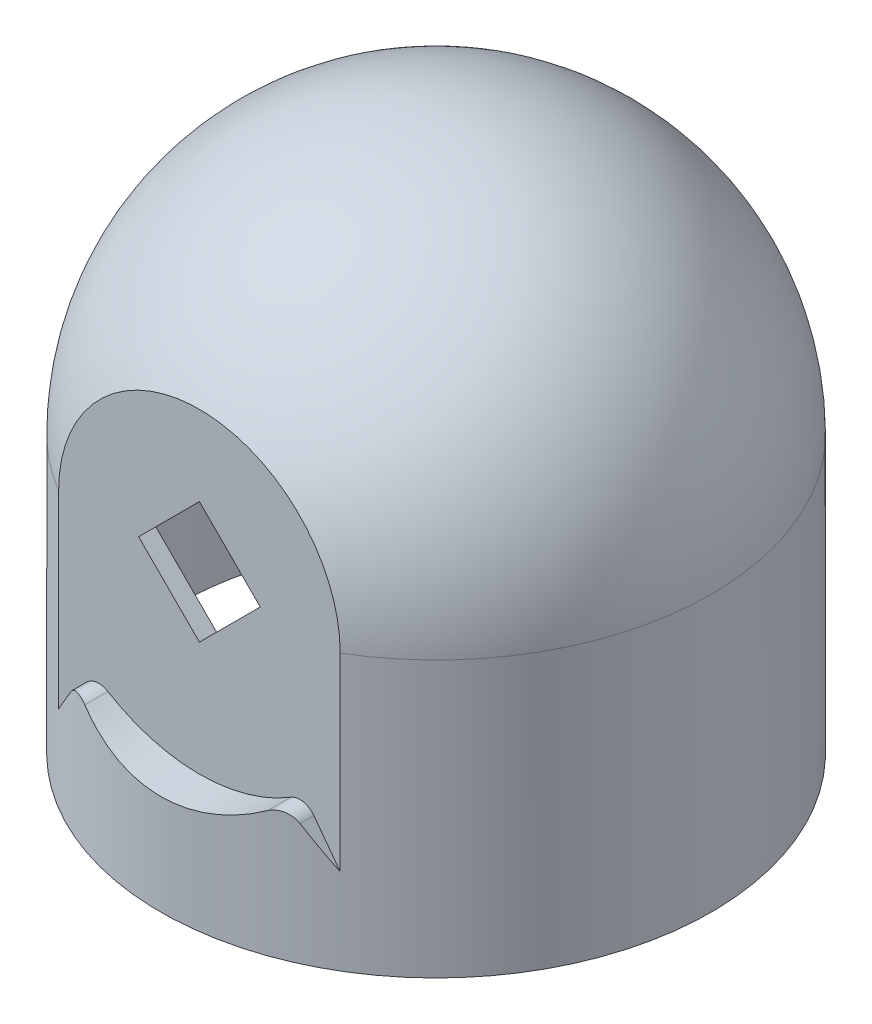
ISO-10303-21;
HEADER;
FILE_DESCRIPTION(('STEP AP214'),'2;1');
FILE_NAME('part.step','',(''),(''),'','','');
FILE_SCHEMA(('AUTOMOTIVE_DESIGN { 1 0 10303 214 1 1 1 1 }'));
ENDSEC;
DATA;
#1=APPLICATION_CONTEXT('core data for automotive mechanical design processes');
#2=APPLICATION_PROTOCOL_DEFINITION('international standard','automotive_design',2000,#1);
#3=PRODUCT_CONTEXT('',#1,'mechanical');
#4=PRODUCT('Part','Part','',(#3));
#5=PRODUCT_RELATED_PRODUCT_CATEGORY('part','',(#4));
#6=PRODUCT_DEFINITION_FORMATION('','',#4);
#7=PRODUCT_DEFINITION_CONTEXT('part definition',#1,'design');
#8=PRODUCT_DEFINITION('design','',#6,#7);
#9=PRODUCT_DEFINITION_SHAPE('','',#8);
#10=(LENGTH_UNIT() NAMED_UNIT(*) SI_UNIT(.MILLI.,.METRE.));
#11=(NAMED_UNIT(*) PLANE_ANGLE_UNIT() SI_UNIT($,.RADIAN.));
#12=(NAMED_UNIT(*) SI_UNIT($,.STERADIAN.) SOLID_ANGLE_UNIT());
#13=UNCERTAINTY_MEASURE_WITH_UNIT(LENGTH_MEASURE(1.E-05),#10,'distance_accuracy_value','');
#14=(GEOMETRIC_REPRESENTATION_CONTEXT(3) GLOBAL_UNCERTAINTY_ASSIGNED_CONTEXT((#13)) GLOBAL_UNIT_ASSIGNED_CONTEXT((#10,
#11,#12)) REPRESENTATION_CONTEXT('',''));
#15=CARTESIAN_POINT('',(0.,0.,0.));
#16=DIRECTION('',(0.,0.,1.));
#17=DIRECTION('',(1.,0.,0.));
#18=AXIS2_PLACEMENT_3D('',#15,#16,#17);
#19=CARTESIAN_POINT('',(0.,16.,13.75));
#20=DIRECTION('',(0.,0.,1.));
#21=DIRECTION('',(1.,0.,0.));
#22=AXIS2_PLACEMENT_3D('',#19,#20,#21);
#23=PLANE('',#22);
#24=DIRECTION('',(-0.707106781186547,-0.707106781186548,0.));
#25=VECTOR('',#24,1.);
#26=CARTESIAN_POINT('',(-3.53553390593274,16.,13.75));
#27=LINE('',#26,#25);
#28=CARTESIAN_POINT('',(0.,19.5355339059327,13.75));
#29=VERTEX_POINT('',#28);
#30=CARTESIAN_POINT('',(-3.53553390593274,16.,13.75));
#31=VERTEX_POINT('',#30);
#32=EDGE_CURVE('E473',#29,#31,#27,.T.);
#33=ORIENTED_EDGE('',*,*,#32,.F.);
#34=DIRECTION('',(-0.707106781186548,0.707106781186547,0.));
#35=VECTOR('',#34,1.);
#36=CARTESIAN_POINT('',(0.,19.5355339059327,13.75));
#37=LINE('',#36,#35);
#38=CARTESIAN_POINT('',(3.53553390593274,16.,13.75));
#39=VERTEX_POINT('',#38);
#40=EDGE_CURVE('E460',#39,#29,#37,.T.);
#41=ORIENTED_EDGE('',*,*,#40,.F.);
#42=DIRECTION('',(0.707106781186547,0.707106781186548,0.));
#43=VECTOR('',#42,1.);
#44=CARTESIAN_POINT('',(0.,12.4644660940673,13.75));
#45=LINE('',#44,#43);
#46=CARTESIAN_POINT('',(0.,12.4644660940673,13.75));
#47=VERTEX_POINT('',#46);
#48=EDGE_CURVE('E466',#47,#39,#45,.T.);
#49=ORIENTED_EDGE('',*,*,#48,.F.);
#50=DIRECTION('',(0.707106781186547,-0.707106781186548,0.));
#51=VECTOR('',#50,1.);
#52=CARTESIAN_POINT('',(-3.53553390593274,16.,13.75));
#53=LINE('',#52,#51);
#54=EDGE_CURVE('E470',#31,#47,#53,.T.);
#55=ORIENTED_EDGE('',*,*,#54,.F.);
#56=EDGE_LOOP('',(#33,#41,#49,#55));
#57=FACE_BOUND('',#56,.T.);
#58=CARTESIAN_POINT('',(0.,16.,13.75));
#59=DIRECTION('',(0.,0.,-1.));
#60=DIRECTION('',(1.,0.,0.));
#61=AXIS2_PLACEMENT_3D('',#58,#59,#60);
#62=CIRCLE('',#61,10.1815340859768);
#63=CARTESIAN_POINT('',(5.32134905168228,7.31974190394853,13.75));
#64=VERTEX_POINT('',#63);
#65=CARTESIAN_POINT('',(-5.32134905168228,7.31974190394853,13.75));
#66=VERTEX_POINT('',#65);
#67=EDGE_CURVE('E438',#64,#66,#62,.T.);
#68=ORIENTED_EDGE('',*,*,#67,.F.);
#69=CARTESIAN_POINT('',(5.84399613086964,6.46719276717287,13.75));
#70=DIRECTION('',(0.,0.,1.));
#71=DIRECTION('',(1.,0.,0.));
#72=AXIS2_PLACEMENT_3D('',#69,#70,#71);
#73=CIRCLE('',#72,1.);
#74=CARTESIAN_POINT('',(6.64638697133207,7.06399167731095,13.75));
#75=VERTEX_POINT('',#74);
#76=EDGE_CURVE('E375',#64,#75,#73,.F.);
#77=ORIENTED_EDGE('',*,*,#76,.T.);
#78=DIRECTION('',(-0.596798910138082,0.802390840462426,0.));
#79=VECTOR('',#78,1.);
#80=CARTESIAN_POINT('',(6.07632844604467,7.83043030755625,13.75));
#81=LINE('',#80,#79);
#82=CARTESIAN_POINT('',(8.18153408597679,5.,13.75));
#83=VERTEX_POINT('',#82);
#84=EDGE_CURVE('E440',#83,#75,#81,.T.);
#85=ORIENTED_EDGE('',*,*,#84,.F.);
#86=DIRECTION('',(0.,1.,0.));
#87=VECTOR('',#86,1.);
#88=CARTESIAN_POINT('',(8.18153408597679,5.,13.75));
#89=LINE('',#88,#87);
#90=CARTESIAN_POINT('',(8.18153408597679,16.,13.75));
#91=VERTEX_POINT('',#90);
#92=EDGE_CURVE('E400',#83,#91,#89,.T.);
#93=ORIENTED_EDGE('',*,*,#92,.T.);
#94=CARTESIAN_POINT('',(0.,16.,13.75));
#95=DIRECTION('',(0.,0.,1.));
#96=DIRECTION('',(1.,0.,0.));
#97=AXIS2_PLACEMENT_3D('',#94,#95,#96);
#98=CIRCLE('',#97,8.18153408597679);
#99=CARTESIAN_POINT('',(-8.18153408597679,16.,13.75));
#100=VERTEX_POINT('',#99);
#101=EDGE_CURVE('E398',#91,#100,#98,.T.);
#102=ORIENTED_EDGE('',*,*,#101,.T.);
#103=DIRECTION('',(0.,-1.,0.));
#104=VECTOR('',#103,1.);
#105=CARTESIAN_POINT('',(-8.18153408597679,16.,13.75));
#106=LINE('',#105,#104);
#107=CARTESIAN_POINT('',(-8.18153408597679,5.,13.75));
#108=VERTEX_POINT('',#107);
#109=EDGE_CURVE('E395',#100,#108,#106,.T.);
#110=ORIENTED_EDGE('',*,*,#109,.T.);
#111=DIRECTION('',(-0.596798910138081,-0.802390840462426,0.));
#112=VECTOR('',#111,1.);
#113=CARTESIAN_POINT('',(-8.18153408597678,5.,13.75));
#114=LINE('',#113,#112);
#115=CARTESIAN_POINT('',(-6.64638697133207,7.06399167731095,13.75));
#116=VERTEX_POINT('',#115);
#117=EDGE_CURVE('E424',#116,#108,#114,.T.);
#118=ORIENTED_EDGE('',*,*,#117,.F.);
#119=CARTESIAN_POINT('',(-5.84399613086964,6.46719276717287,13.75));
#120=DIRECTION('',(0.,0.,1.));
#121=DIRECTION('',(1.,0.,0.));
#122=AXIS2_PLACEMENT_3D('',#119,#120,#121);
#123=CIRCLE('',#122,1.);
#124=EDGE_CURVE('E431',#116,#66,#123,.F.);
#125=ORIENTED_EDGE('',*,*,#124,.T.);
#126=EDGE_LOOP('',(#68,#77,#85,#93,#102,#110,#118,#125));
#127=FACE_BOUND('',#126,.T.);
#128=ADVANCED_FACE('F38',(#57,#127),#23,.T.);
#129=CARTESIAN_POINT('',(0.,0.,0.));
#130=DIRECTION('',(0.,-1.,0.));
#131=DIRECTION('',(0.,0.,-1.));
#132=AXIS2_PLACEMENT_3D('',#129,#130,#131);
#133=CYLINDRICAL_SURFACE('',#132,16.);
#134=CARTESIAN_POINT('',(0.,16.,0.));
#135=DIRECTION('',(-0.802390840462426,0.596798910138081,0.));
#136=DIRECTION('',(-0.596798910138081,-0.802390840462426,0.));
#137=AXIS2_PLACEMENT_3D('',#134,#135,#136);
#138=ELLIPSE('',#137,26.809700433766,16.);
#139=CARTESIAN_POINT('',(-6.64638697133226,7.06399167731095,-14.5542275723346));
#140=VERTEX_POINT('',#139);
#141=CARTESIAN_POINT('',(-8.18153408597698,5.,-13.7499999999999));
#142=VERTEX_POINT('',#141);
#143=EDGE_CURVE('E239',#140,#142,#138,.T.);
#144=ORIENTED_EDGE('',*,*,#143,.F.);
#145=CARTESIAN_POINT('',(-6.64638697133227,7.06399167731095,-14.5542275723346));
#146=CARTESIAN_POINT('',(-6.61111325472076,7.11146138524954,-14.5703418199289));
#147=CARTESIAN_POINT('',(-6.57191947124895,7.15533077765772,-14.5880801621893));
#148=CARTESIAN_POINT('',(-6.48725070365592,7.23503252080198,-14.6259246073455));
#149=CARTESIAN_POINT('',(-6.44179357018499,7.27088697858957,-14.6460239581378));
#150=CARTESIAN_POINT('',(-6.3460174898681,7.33394717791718,-14.6877771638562));
#151=CARTESIAN_POINT('',(-6.29570611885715,7.36116612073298,-14.7094285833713));
#152=CARTESIAN_POINT('',(-6.19149203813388,7.40659606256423,-14.7535970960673));
#153=CARTESIAN_POINT('',(-6.13758715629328,7.42480155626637,-14.7761147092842));
#154=CARTESIAN_POINT('',(-6.02466040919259,7.4525432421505,-14.8225295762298));
#155=CARTESIAN_POINT('',(-5.96551842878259,7.46157507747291,-14.8464372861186));
#156=CARTESIAN_POINT('',(-5.84633573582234,7.4689713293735,-14.8937728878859));
#157=CARTESIAN_POINT('',(-5.78629450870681,7.467329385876,-14.9172004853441));
#158=CARTESIAN_POINT('',(-5.6663265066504,7.45315809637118,-14.9631855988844));
#159=CARTESIAN_POINT('',(-5.60640975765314,7.44049829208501,-14.9857292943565));
#160=CARTESIAN_POINT('',(-5.48941631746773,7.40421163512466,-15.0289778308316));
#161=CARTESIAN_POINT('',(-5.43233263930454,7.38061341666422,-15.0496873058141));
#162=CARTESIAN_POINT('',(-5.35858025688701,7.34174514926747,-15.0760088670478));
#163=CARTESIAN_POINT('',(-5.33979513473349,7.33105547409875,-15.0826720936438));
#164=CARTESIAN_POINT('',(-5.32134905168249,7.31974190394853,-15.0891763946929));
#165=B_SPLINE_CURVE_WITH_KNOTS('',3,(#145,#146,#147,#148,#149,#150,#151,#152,#153,#154,#155,
#156,#157,#158,#159,#160,#161,#162,#163,#164),.UNSPECIFIED.,.F.,.F.,(4,2,2,2,2,2,2,2,2,4),(0.,
0.183493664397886,0.36647478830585,0.549174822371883,0.731986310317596,0.924378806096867,
1.11688595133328,1.31170399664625,1.50601490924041,1.57382019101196),.UNSPECIFIED.);
#166=CARTESIAN_POINT('',(-5.3213490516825,7.31974190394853,-15.0891763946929));
#167=VERTEX_POINT('',#166);
#168=EDGE_CURVE('E336',#140,#167,#165,.T.);
#169=ORIENTED_EDGE('',*,*,#168,.T.);
#170=CARTESIAN_POINT('',(6.07632844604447,7.83043030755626,-14.8012915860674));
#171=CARTESIAN_POINT('',(5.86995259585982,7.67692601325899,-14.8860376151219));
#172=CARTESIAN_POINT('',(5.65706106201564,7.53073686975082,-14.9683686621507));
#173=CARTESIAN_POINT('',(5.21892586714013,7.25393700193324,-15.1266958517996));
#174=CARTESIAN_POINT('',(4.99367371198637,7.12333719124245,-15.202687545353));
#175=CARTESIAN_POINT('',(4.53069446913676,6.87830295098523,-15.3470491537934));
#176=CARTESIAN_POINT('',(4.29291344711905,6.76394785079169,-15.4153813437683));
#177=CARTESIAN_POINT('',(3.80705919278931,6.55330640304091,-15.5425004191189));
#178=CARTESIAN_POINT('',(3.55898815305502,6.45701623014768,-15.6012893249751));
#179=CARTESIAN_POINT('',(3.05274936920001,6.28319473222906,-15.7082128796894));
#180=CARTESIAN_POINT('',(2.7945397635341,6.20575341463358,-15.7562963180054));
#181=CARTESIAN_POINT('',(2.27088218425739,6.07126390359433,-15.8402462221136));
#182=CARTESIAN_POINT('',(2.00543376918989,6.01421695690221,-15.8761119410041));
#183=CARTESIAN_POINT('',(1.47011819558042,5.92150920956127,-15.934586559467));
#184=CARTESIAN_POINT('',(1.20026478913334,5.88579149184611,-15.9572307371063));
#185=CARTESIAN_POINT('',(0.657777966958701,5.83608673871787,-15.9887811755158));
#186=CARTESIAN_POINT('',(0.385144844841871,5.82209743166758,-15.9976888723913));
#187=CARTESIAN_POINT('',(-0.136852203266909,5.81633464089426,-16.0013564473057));
#188=CARTESIAN_POINT('',(-0.386190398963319,5.82274531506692,-15.9972727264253));
#189=CARTESIAN_POINT('',(-0.883257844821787,5.85379418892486,-15.9775376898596));
#190=CARTESIAN_POINT('',(-1.13098717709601,5.87843145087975,-15.9618869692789));
#191=CARTESIAN_POINT('',(-1.623257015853,5.94562534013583,-15.9193636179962));
#192=CARTESIAN_POINT('',(-1.86779428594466,5.98819888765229,-15.8924803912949));
#193=CARTESIAN_POINT('',(-2.351764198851,6.09070998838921,-15.8281016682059));
#194=CARTESIAN_POINT('',(-2.59119687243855,6.15064743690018,-15.7906062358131));
#195=CARTESIAN_POINT('',(-3.06001870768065,6.28616467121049,-15.7064376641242));
#196=CARTESIAN_POINT('',(-3.28950352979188,6.36150294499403,-15.6599067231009));
#197=CARTESIAN_POINT('',(-3.74096894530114,6.52758388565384,-15.5582363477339));
#198=CARTESIAN_POINT('',(-3.96294620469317,6.61833329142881,-15.5030931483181));
#199=CARTESIAN_POINT('',(-4.39801988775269,6.81425462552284,-15.3853229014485));
#200=CARTESIAN_POINT('',(-4.61112669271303,6.91940903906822,-15.3227049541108));
#201=CARTESIAN_POINT('',(-5.02794832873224,7.14340115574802,-15.1910334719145));
#202=CARTESIAN_POINT('',(-5.23166346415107,7.2622384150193,-15.1219801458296));
#203=CARTESIAN_POINT('',(-5.54128473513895,7.45745860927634,-15.0102661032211));
#204=CARTESIAN_POINT('',(-5.65066556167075,7.52942158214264,-14.9694128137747));
#205=CARTESIAN_POINT('',(-5.86601722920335,7.67711055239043,-14.8863406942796));
#206=CARTESIAN_POINT('',(-5.97199366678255,7.75282979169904,-14.8441243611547));
#207=CARTESIAN_POINT('',(-6.07632844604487,7.83043030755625,-14.8012915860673));
#208=B_SPLINE_CURVE_WITH_KNOTS('',3,(#170,#171,#172,#173,#174,#175,#176,#177,#178,#179,#180,
#181,#182,#183,#184,#185,#186,#187,#188,#189,#190,#191,#192,#193,#194,#195,#196,#197,#198,#199,
#200,#201,#202,#203,#204,#205,#206,#207),.UNSPECIFIED.,.F.,.F.,(4,2,2,2,2,2,2,2,2,2,2,2,2,2,2,2,
2,2,4),(0.,0.812329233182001,1.62522385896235,2.44196091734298,3.25852483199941,
4.07891471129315,4.89935473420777,5.71759551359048,6.53575074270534,7.28318328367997,
8.03057737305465,8.77867810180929,9.52677431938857,10.2639329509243,11.0014147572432,
11.7380077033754,12.474576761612,12.885956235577,13.2966206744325),.UNSPECIFIED.);
#209=CARTESIAN_POINT('',(5.32134905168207,7.31974190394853,-15.0891763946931));
#210=VERTEX_POINT('',#209);
#211=EDGE_CURVE('E242',#210,#167,#208,.T.);
#212=ORIENTED_EDGE('',*,*,#211,.F.);
#213=CARTESIAN_POINT('',(5.32134905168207,7.31974190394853,-15.0891763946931));
#214=CARTESIAN_POINT('',(5.37222341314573,7.35097453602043,-15.0712484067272));
#215=CARTESIAN_POINT('',(5.42555923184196,7.37736338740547,-15.0521373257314));
#216=CARTESIAN_POINT('',(5.53531531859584,7.42016464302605,-15.0121143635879));
#217=CARTESIAN_POINT('',(5.59172825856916,7.43659971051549,-14.9912066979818));
#218=CARTESIAN_POINT('',(5.70599906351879,7.45933961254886,-14.9480878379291));
#219=CARTESIAN_POINT('',(5.76385564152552,7.46565316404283,-14.9258777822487));
#220=CARTESIAN_POINT('',(5.87951089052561,7.46823444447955,-14.8806989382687));
#221=CARTESIAN_POINT('',(5.93730953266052,7.46449850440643,-14.8577298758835));
#222=CARTESIAN_POINT('',(6.05347926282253,7.44683389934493,-14.8107886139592));
#223=CARTESIAN_POINT('',(6.11179142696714,7.43253061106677,-14.7868109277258));
#224=CARTESIAN_POINT('',(6.22519195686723,7.39362936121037,-14.7394289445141));
#225=CARTESIAN_POINT('',(6.28027768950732,7.36902312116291,-14.7160251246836));
#226=CARTESIAN_POINT('',(6.38595432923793,7.3097956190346,-14.6704780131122));
#227=CARTESIAN_POINT('',(6.43651019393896,7.27510384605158,-14.6483449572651));
#228=CARTESIAN_POINT('',(6.53088696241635,7.19652702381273,-14.6065112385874));
#229=CARTESIAN_POINT('',(6.57472827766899,7.15267083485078,-14.5868032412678));
#230=CARTESIAN_POINT('',(6.62536554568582,7.09150301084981,-14.5638141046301));
#231=CARTESIAN_POINT('',(6.63604884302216,7.07789562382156,-14.5589488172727));
#232=CARTESIAN_POINT('',(6.64638697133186,7.06399167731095,-14.5542275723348));
#233=B_SPLINE_CURVE_WITH_KNOTS('',3,(#213,#214,#215,#216,#217,#218,#219,#220,#221,#222,#223,
#224,#225,#226,#227,#228,#229,#230,#231,#232),.UNSPECIFIED.,.F.,.F.,(4,2,2,2,2,2,2,2,2,4),(0.,
0.186640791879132,0.372855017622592,0.558908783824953,0.74503048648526,0.938087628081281,
1.13130019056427,1.32589745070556,1.51989088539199,1.57377947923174),.UNSPECIFIED.);
#234=CARTESIAN_POINT('',(6.64638697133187,7.06399167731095,-14.5542275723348));
#235=VERTEX_POINT('',#234);
#236=EDGE_CURVE('E60',#210,#235,#233,.T.);
#237=ORIENTED_EDGE('',*,*,#236,.T.);
#238=CARTESIAN_POINT('',(0.,16.,0.));
#239=DIRECTION('',(0.802390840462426,0.596798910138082,0.));
#240=DIRECTION('',(0.596798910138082,-0.802390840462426,0.));
#241=AXIS2_PLACEMENT_3D('',#238,#239,#240);
#242=ELLIPSE('',#241,26.809700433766,16.);
#243=CARTESIAN_POINT('',(8.18153408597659,5.,-13.7500000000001));
#244=VERTEX_POINT('',#243);
#245=EDGE_CURVE('E251',#244,#235,#242,.T.);
#246=ORIENTED_EDGE('',*,*,#245,.F.);
#247=DIRECTION('',(0.,1.,0.));
#248=VECTOR('',#247,1.);
#249=CARTESIAN_POINT('',(8.18153408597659,5.,-13.7500000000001));
#250=LINE('',#249,#248);
#251=CARTESIAN_POINT('',(8.18153408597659,16.,-13.7500000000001));
#252=VERTEX_POINT('',#251);
#253=EDGE_CURVE('E490',#244,#252,#250,.T.);
#254=ORIENTED_EDGE('',*,*,#253,.T.);
#255=CARTESIAN_POINT('',(0.,16.,0.));
#256=DIRECTION('',(0.,-1.,0.));
#257=DIRECTION('',(0.,0.,-1.));
#258=AXIS2_PLACEMENT_3D('',#255,#256,#257);
#259=CIRCLE('',#258,16.);
#260=EDGE_CURVE('E391',#252,#91,#259,.T.);
#261=ORIENTED_EDGE('',*,*,#260,.T.);
#262=ORIENTED_EDGE('',*,*,#92,.F.);
#263=CARTESIAN_POINT('',(0.,16.,0.));
#264=DIRECTION('',(-0.802390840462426,-0.596798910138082,0.));
#265=DIRECTION('',(0.596798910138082,-0.802390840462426,0.));
#266=AXIS2_PLACEMENT_3D('',#263,#264,#265);
#267=ELLIPSE('',#266,26.809700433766,16.);
#268=CARTESIAN_POINT('',(6.64638697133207,7.06399167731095,14.5542275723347));
#269=VERTEX_POINT('',#268);
#270=EDGE_CURVE('E423',#83,#269,#267,.T.);
#271=ORIENTED_EDGE('',*,*,#270,.T.);
#272=CARTESIAN_POINT('',(6.64638697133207,7.06399167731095,14.5542275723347));
#273=CARTESIAN_POINT('',(6.61111325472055,7.11146138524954,14.570341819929));
#274=CARTESIAN_POINT('',(6.57191947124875,7.15533077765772,14.5880801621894));
#275=CARTESIAN_POINT('',(6.48725070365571,7.23503252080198,14.6259246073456));
#276=CARTESIAN_POINT('',(6.44179357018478,7.27088697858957,14.6460239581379));
#277=CARTESIAN_POINT('',(6.34601748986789,7.33394717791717,14.6877771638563));
#278=CARTESIAN_POINT('',(6.29570611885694,7.36116612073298,14.7094285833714));
#279=CARTESIAN_POINT('',(6.19149203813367,7.40659606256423,14.7535970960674));
#280=CARTESIAN_POINT('',(6.13758715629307,7.42480155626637,14.7761147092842));
#281=CARTESIAN_POINT('',(6.02466040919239,7.4525432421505,14.8225295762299));
#282=CARTESIAN_POINT('',(5.96551842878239,7.46157507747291,14.8464372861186));
#283=CARTESIAN_POINT('',(5.84633573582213,7.4689713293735,14.893772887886));
#284=CARTESIAN_POINT('',(5.7862945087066,7.467329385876,14.9172004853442));
#285=CARTESIAN_POINT('',(5.66632650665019,7.45315809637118,14.9631855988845));
#286=CARTESIAN_POINT('',(5.60640975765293,7.44049829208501,14.9857292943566));
#287=CARTESIAN_POINT('',(5.48941631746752,7.40421163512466,15.0289778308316));
#288=CARTESIAN_POINT('',(5.43233263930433,7.38061341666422,15.0496873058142));
#289=CARTESIAN_POINT('',(5.3585802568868,7.34174514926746,15.0760088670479));
#290=CARTESIAN_POINT('',(5.33979513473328,7.33105547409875,15.0826720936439));
#291=CARTESIAN_POINT('',(5.32134905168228,7.31974190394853,15.089176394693));
#292=B_SPLINE_CURVE_WITH_KNOTS('',3,(#272,#273,#274,#275,#276,#277,#278,#279,#280,#281,#282,
#283,#284,#285,#286,#287,#288,#289,#290,#291),.UNSPECIFIED.,.F.,.F.,(4,2,2,2,2,2,2,2,2,4),(0.,
0.183493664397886,0.366474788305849,0.549174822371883,0.731986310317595,0.924378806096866,
1.11688595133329,1.31170399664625,1.50601490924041,1.57382019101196),.UNSPECIFIED.);
#293=CARTESIAN_POINT('',(5.32134905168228,7.31974190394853,15.089176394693));
#294=VERTEX_POINT('',#293);
#295=EDGE_CURVE('E326',#269,#294,#292,.T.);
#296=ORIENTED_EDGE('',*,*,#295,.T.);
#297=CARTESIAN_POINT('',(6.07632844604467,7.83043030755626,14.8012915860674));
#298=CARTESIAN_POINT('',(5.86995259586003,7.67692601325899,14.8860376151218));
#299=CARTESIAN_POINT('',(5.65706106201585,7.53073686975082,14.9683686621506));
#300=CARTESIAN_POINT('',(5.21892586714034,7.25393700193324,15.1266958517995));
#301=CARTESIAN_POINT('',(4.99367371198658,7.12333719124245,15.2026875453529));
#302=CARTESIAN_POINT('',(4.53069446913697,6.87830295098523,15.3470491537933));
#303=CARTESIAN_POINT('',(4.29291344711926,6.76394785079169,15.4153813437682));
#304=CARTESIAN_POINT('',(3.80705919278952,6.55330640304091,15.5425004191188));
#305=CARTESIAN_POINT('',(3.55898815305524,6.45701623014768,15.6012893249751));
#306=CARTESIAN_POINT('',(3.05274936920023,6.28319473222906,15.7082128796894));
#307=CARTESIAN_POINT('',(2.79453976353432,6.20575341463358,15.7562963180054));
#308=CARTESIAN_POINT('',(2.27088218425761,6.07126390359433,15.8402462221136));
#309=CARTESIAN_POINT('',(2.00543376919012,6.01421695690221,15.8761119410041));
#310=CARTESIAN_POINT('',(1.47011819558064,5.92150920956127,15.934586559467));
#311=CARTESIAN_POINT('',(1.20026478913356,5.88579149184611,15.9572307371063));
#312=CARTESIAN_POINT('',(0.657777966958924,5.83608673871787,15.9887811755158));
#313=CARTESIAN_POINT('',(0.385144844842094,5.82209743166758,15.9976888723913));
#314=CARTESIAN_POINT('',(-0.136852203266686,5.81633464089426,16.0013564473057));
#315=CARTESIAN_POINT('',(-0.386190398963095,5.82274531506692,15.9972727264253));
#316=CARTESIAN_POINT('',(-0.883257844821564,5.85379418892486,15.9775376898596));
#317=CARTESIAN_POINT('',(-1.13098717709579,5.87843145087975,15.9618869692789));
#318=CARTESIAN_POINT('',(-1.62325701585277,5.94562534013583,15.9193636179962));
#319=CARTESIAN_POINT('',(-1.86779428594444,5.98819888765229,15.8924803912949));
#320=CARTESIAN_POINT('',(-2.35176419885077,6.09070998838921,15.8281016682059));
#321=CARTESIAN_POINT('',(-2.59119687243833,6.15064743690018,15.7906062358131));
#322=CARTESIAN_POINT('',(-3.06001870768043,6.28616467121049,15.7064376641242));
#323=CARTESIAN_POINT('',(-3.28950352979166,6.36150294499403,15.659906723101));
#324=CARTESIAN_POINT('',(-3.74096894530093,6.52758388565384,15.5582363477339));
#325=CARTESIAN_POINT('',(-3.96294620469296,6.61833329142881,15.5030931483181));
#326=CARTESIAN_POINT('',(-4.39801988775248,6.81425462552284,15.3853229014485));
#327=CARTESIAN_POINT('',(-4.61112669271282,6.91940903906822,15.3227049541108));
#328=CARTESIAN_POINT('',(-5.02794832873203,7.14340115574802,15.1910334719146));
#329=CARTESIAN_POINT('',(-5.23166346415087,7.2622384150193,15.1219801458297));
#330=CARTESIAN_POINT('',(-5.54128473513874,7.45745860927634,15.0102661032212));
#331=CARTESIAN_POINT('',(-5.65066556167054,7.52942158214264,14.9694128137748));
#332=CARTESIAN_POINT('',(-5.86601722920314,7.67711055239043,14.8863406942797));
#333=CARTESIAN_POINT('',(-5.97199366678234,7.75282979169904,14.8441243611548));
#334=CARTESIAN_POINT('',(-6.07632844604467,7.83043030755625,14.8012915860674));
#335=B_SPLINE_CURVE_WITH_KNOTS('',3,(#297,#298,#299,#300,#301,#302,#303,#304,#305,#306,#307,
#308,#309,#310,#311,#312,#313,#314,#315,#316,#317,#318,#319,#320,#321,#322,#323,#324,#325,#326,
#327,#328,#329,#330,#331,#332,#333,#334),.UNSPECIFIED.,.F.,.F.,(4,2,2,2,2,2,2,2,2,2,2,2,2,2,2,2,
2,2,4),(0.,0.812329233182,1.62522385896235,2.44196091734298,3.25852483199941,4.07891471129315,
4.89935473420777,5.71759551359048,6.53575074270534,7.28318328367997,8.03057737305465,
8.77867810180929,9.52677431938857,10.2639329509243,11.0014147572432,11.7380077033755,
12.474576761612,12.885956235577,13.2966206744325),.UNSPECIFIED.);
#336=CARTESIAN_POINT('',(-5.32134905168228,7.31974190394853,15.089176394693));
#337=VERTEX_POINT('',#336);
#338=EDGE_CURVE('E308',#294,#337,#335,.T.);
#339=ORIENTED_EDGE('',*,*,#338,.T.);
#340=CARTESIAN_POINT('',(-5.32134905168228,7.31974190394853,15.089176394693));
#341=CARTESIAN_POINT('',(-5.37222341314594,7.35097453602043,15.0712484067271));
#342=CARTESIAN_POINT('',(-5.42555923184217,7.37736338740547,15.0521373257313));
#343=CARTESIAN_POINT('',(-5.53531531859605,7.42016464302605,15.0121143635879));
#344=CARTESIAN_POINT('',(-5.59172825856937,7.43659971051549,14.9912066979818));
#345=CARTESIAN_POINT('',(-5.705999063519,7.45933961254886,14.948087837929));
#346=CARTESIAN_POINT('',(-5.76385564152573,7.46565316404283,14.9258777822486));
#347=CARTESIAN_POINT('',(-5.87951089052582,7.46823444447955,14.8806989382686));
#348=CARTESIAN_POINT('',(-5.93730953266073,7.46449850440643,14.8577298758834));
#349=CARTESIAN_POINT('',(-6.05347926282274,7.44683389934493,14.8107886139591));
#350=CARTESIAN_POINT('',(-6.11179142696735,7.43253061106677,14.7868109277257));
#351=CARTESIAN_POINT('',(-6.22519195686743,7.39362936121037,14.739428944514));
#352=CARTESIAN_POINT('',(-6.28027768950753,7.36902312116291,14.7160251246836));
#353=CARTESIAN_POINT('',(-6.38595432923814,7.3097956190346,14.6704780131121));
#354=CARTESIAN_POINT('',(-6.43651019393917,7.27510384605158,14.648344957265));
#355=CARTESIAN_POINT('',(-6.53088696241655,7.19652702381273,14.6065112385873));
#356=CARTESIAN_POINT('',(-6.57472827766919,7.15267083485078,14.5868032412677));
#357=CARTESIAN_POINT('',(-6.62536554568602,7.09150301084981,14.56381410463));
#358=CARTESIAN_POINT('',(-6.63604884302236,7.07789562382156,14.5589488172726));
#359=CARTESIAN_POINT('',(-6.64638697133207,7.06399167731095,14.5542275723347));
#360=B_SPLINE_CURVE_WITH_KNOTS('',3,(#340,#341,#342,#343,#344,#345,#346,#347,#348,#349,#350,
#351,#352,#353,#354,#355,#356,#357,#358,#359),.UNSPECIFIED.,.F.,.F.,(4,2,2,2,2,2,2,2,2,4),(0.,
0.186640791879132,0.372855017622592,0.558908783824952,0.745030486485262,0.938087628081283,
1.13130019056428,1.32589745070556,1.51989088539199,1.57377947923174),.UNSPECIFIED.);
#361=CARTESIAN_POINT('',(-6.64638697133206,7.06399167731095,14.5542275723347));
#362=VERTEX_POINT('',#361);
#363=EDGE_CURVE('E319',#337,#362,#360,.T.);
#364=ORIENTED_EDGE('',*,*,#363,.T.);
#365=CARTESIAN_POINT('',(0.,16.,0.));
#366=DIRECTION('',(0.802390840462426,-0.596798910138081,0.));
#367=DIRECTION('',(-0.596798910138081,-0.802390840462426,0.));
#368=AXIS2_PLACEMENT_3D('',#365,#366,#367);
#369=ELLIPSE('',#368,26.809700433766,16.);
#370=EDGE_CURVE('E422',#362,#108,#369,.T.);
#371=ORIENTED_EDGE('',*,*,#370,.T.);
#372=ORIENTED_EDGE('',*,*,#109,.F.);
#373=CARTESIAN_POINT('',(-8.18153408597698,16.,-13.7499999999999));
#374=VERTEX_POINT('',#373);
#375=EDGE_CURVE('E394',#100,#374,#259,.T.);
#376=ORIENTED_EDGE('',*,*,#375,.T.);
#377=DIRECTION('',(0.,-1.,0.));
#378=VECTOR('',#377,1.);
#379=CARTESIAN_POINT('',(-8.18153408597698,16.,-13.7499999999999));
#380=LINE('',#379,#378);
#381=EDGE_CURVE('E484',#374,#142,#380,.T.);
#382=ORIENTED_EDGE('',*,*,#381,.T.);
#383=EDGE_LOOP('',(#144,#169,#212,#237,#246,#254,#261,#262,#271,#296,#339,#364,#371,#372,#376,#382));
#384=FACE_BOUND('',#383,.T.);
#385=CARTESIAN_POINT('',(0.,0.,0.));
#386=DIRECTION('',(0.,-1.,0.));
#387=DIRECTION('',(0.,0.,-1.));
#388=AXIS2_PLACEMENT_3D('',#385,#386,#387);
#389=CIRCLE('',#388,16.);
#390=CARTESIAN_POINT('',(0.,0.,-16.));
#391=VERTEX_POINT('',#390);
#392=EDGE_CURVE('E388',#391,#391,#389,.T.);
#393=ORIENTED_EDGE('',*,*,#392,.F.);
#394=EDGE_LOOP('',(#393));
#395=FACE_BOUND('',#394,.T.);
#396=ADVANCED_FACE('F285',(#384,#395),#133,.T.);
#397=CARTESIAN_POINT('',(0.,16.,0.));
#398=DIRECTION('',(0.,-1.,0.));
#399=DIRECTION('',(1.,0.,0.));
#400=AXIS2_PLACEMENT_3D('',#397,#398,#399);
#401=SPHERICAL_SURFACE('',#400,16.);
#402=ORIENTED_EDGE('',*,*,#375,.F.);
#403=ORIENTED_EDGE('',*,*,#101,.F.);
#404=ORIENTED_EDGE('',*,*,#260,.F.);
#405=CARTESIAN_POINT('',(-1.92031473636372E-13,16.,-13.75));
#406=DIRECTION('',(0.,0.,1.));
#407=DIRECTION('',(1.,0.,0.));
#408=AXIS2_PLACEMENT_3D('',#405,#406,#407);
#409=CIRCLE('',#408,8.18153408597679);
#410=EDGE_CURVE('E487',#252,#374,#409,.T.);
#411=ORIENTED_EDGE('',*,*,#410,.T.);
#412=EDGE_LOOP('',(#402,#403,#404,#411));
#413=FACE_BOUND('',#412,.T.);
#414=ADVANCED_FACE('F291',(#413),#401,.T.);
#415=CARTESIAN_POINT('',(0.,0.,0.));
#416=DIRECTION('',(0.,-1.,0.));
#417=DIRECTION('',(0.,0.,-1.));
#418=AXIS2_PLACEMENT_3D('',#415,#416,#417);
#419=PLANE('',#418);
#420=CARTESIAN_POINT('',(0.,0.,0.));
#421=DIRECTION('',(0.,-1.,0.));
#422=DIRECTION('',(0.,0.,-1.));
#423=AXIS2_PLACEMENT_3D('',#420,#421,#422);
#424=CIRCLE('',#423,15.);
#425=CARTESIAN_POINT('',(0.,0.,-15.));
#426=VERTEX_POINT('',#425);
#427=EDGE_CURVE('E403',#426,#426,#424,.T.);
#428=ORIENTED_EDGE('',*,*,#427,.F.);
#429=EDGE_LOOP('',(#428));
#430=FACE_BOUND('',#429,.T.);
#431=ORIENTED_EDGE('',*,*,#392,.T.);
#432=EDGE_LOOP('',(#431));
#433=FACE_BOUND('',#432,.T.);
#434=ADVANCED_FACE('F300',(#430,#433),#419,.T.);
#435=CARTESIAN_POINT('',(0.,0.,0.));
#436=DIRECTION('',(0.,-1.,0.));
#437=DIRECTION('',(0.,0.,-1.));
#438=AXIS2_PLACEMENT_3D('',#435,#436,#437);
#439=CYLINDRICAL_SURFACE('',#438,15.);
#440=DIRECTION('',(0.,-1.,0.));
#441=VECTOR('',#440,1.);
#442=CARTESIAN_POINT('',(-7.90174031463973,16.,-12.7499999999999));
#443=LINE('',#442,#441);
#444=CARTESIAN_POINT('',(-7.90174031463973,16.,-12.7499999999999));
#445=VERTEX_POINT('',#444);
#446=CARTESIAN_POINT('',(-7.90174031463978,4.,-12.7499999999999));
#447=VERTEX_POINT('',#446);
#448=EDGE_CURVE('E499',#445,#447,#443,.T.);
#449=ORIENTED_EDGE('',*,*,#448,.F.);
#450=CARTESIAN_POINT('',(0.,16.,0.));
#451=DIRECTION('',(0.,-1.,0.));
#452=DIRECTION('',(0.,0.,-1.));
#453=AXIS2_PLACEMENT_3D('',#450,#451,#452);
#454=CIRCLE('',#453,15.);
#455=CARTESIAN_POINT('',(-7.90174031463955,16.,12.75));
#456=VERTEX_POINT('',#455);
#457=EDGE_CURVE('E417',#456,#445,#454,.T.);
#458=ORIENTED_EDGE('',*,*,#457,.F.);
#459=DIRECTION('',(0.,-1.,0.));
#460=VECTOR('',#459,1.);
#461=CARTESIAN_POINT('',(-7.90174031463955,16.,12.75));
#462=LINE('',#461,#460);
#463=CARTESIAN_POINT('',(-7.9017403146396,4.,12.75));
#464=VERTEX_POINT('',#463);
#465=EDGE_CURVE('E413',#456,#464,#462,.T.);
#466=ORIENTED_EDGE('',*,*,#465,.T.);
#467=CARTESIAN_POINT('',(0.,4.,0.));
#468=DIRECTION('',(0.,1.,0.));
#469=DIRECTION('',(0.,0.,1.));
#470=AXIS2_PLACEMENT_3D('',#467,#468,#469);
#471=CIRCLE('',#470,15.);
#472=CARTESIAN_POINT('',(7.9017403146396,4.,12.75));
#473=VERTEX_POINT('',#472);
#474=EDGE_CURVE('E402',#473,#464,#471,.F.);
#475=ORIENTED_EDGE('',*,*,#474,.F.);
#476=DIRECTION('',(0.,-1.,0.));
#477=VECTOR('',#476,1.);
#478=CARTESIAN_POINT('',(7.9017403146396,4.,12.75));
#479=LINE('',#478,#477);
#480=CARTESIAN_POINT('',(7.90174031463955,16.,12.75));
#481=VERTEX_POINT('',#480);
#482=EDGE_CURVE('E410',#473,#481,#479,.F.);
#483=ORIENTED_EDGE('',*,*,#482,.T.);
#484=CARTESIAN_POINT('',(0.,16.,0.));
#485=DIRECTION('',(0.,-1.,0.));
#486=DIRECTION('',(0.,0.,-1.));
#487=AXIS2_PLACEMENT_3D('',#484,#485,#486);
#488=CIRCLE('',#487,15.);
#489=CARTESIAN_POINT('',(7.90174031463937,16.,-12.7500000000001));
#490=VERTEX_POINT('',#489);
#491=EDGE_CURVE('E406',#490,#481,#488,.T.);
#492=ORIENTED_EDGE('',*,*,#491,.F.);
#493=DIRECTION('',(0.,-1.,0.));
#494=VECTOR('',#493,1.);
#495=CARTESIAN_POINT('',(7.90174031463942,4.,-12.7500000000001));
#496=LINE('',#495,#494);
#497=CARTESIAN_POINT('',(7.90174031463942,4.,-12.7500000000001));
#498=VERTEX_POINT('',#497);
#499=EDGE_CURVE('E495',#498,#490,#496,.F.);
#500=ORIENTED_EDGE('',*,*,#499,.F.);
#501=CARTESIAN_POINT('',(0.,4.,0.));
#502=DIRECTION('',(0.,-1.,0.));
#503=DIRECTION('',(0.,0.,-1.));
#504=AXIS2_PLACEMENT_3D('',#501,#502,#503);
#505=CIRCLE('',#504,15.);
#506=EDGE_CURVE('E493',#498,#447,#505,.F.);
#507=ORIENTED_EDGE('',*,*,#506,.T.);
#508=EDGE_LOOP('',(#449,#458,#466,#475,#483,#492,#500,#507));
#509=FACE_BOUND('',#508,.T.);
#510=ORIENTED_EDGE('',*,*,#427,.T.);
#511=EDGE_LOOP('',(#510));
#512=FACE_BOUND('',#511,.T.);
#513=ADVANCED_FACE('F534',(#509,#512),#439,.F.);
#514=CARTESIAN_POINT('',(0.,16.,0.));
#515=DIRECTION('',(0.,-1.,0.));
#516=DIRECTION('',(1.,0.,0.));
#517=AXIS2_PLACEMENT_3D('',#514,#515,#516);
#518=SPHERICAL_SURFACE('',#517,15.);
#519=CARTESIAN_POINT('',(0.,29.9552857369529,0.));
#520=DIRECTION('',(0.,-1.,0.));
#521=DIRECTION('',(0.,0.,-1.));
#522=AXIS2_PLACEMENT_3D('',#519,#520,#521);
#523=CIRCLE('',#522,5.5);
#524=CARTESIAN_POINT('',(0.,29.9552857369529,-5.5));
#525=VERTEX_POINT('',#524);
#526=EDGE_CURVE('E750',#525,#525,#523,.T.);
#527=ORIENTED_EDGE('',*,*,#526,.F.);
#528=EDGE_LOOP('',(#527));
#529=FACE_BOUND('',#528,.T.);
#530=ORIENTED_EDGE('',*,*,#457,.T.);
#531=CARTESIAN_POINT('',(-1.78065548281E-13,16.,-12.75));
#532=DIRECTION('',(0.,0.,1.));
#533=DIRECTION('',(1.,0.,0.));
#534=AXIS2_PLACEMENT_3D('',#531,#532,#533);
#535=CIRCLE('',#534,7.90174031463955);
#536=EDGE_CURVE('E496',#490,#445,#535,.T.);
#537=ORIENTED_EDGE('',*,*,#536,.F.);
#538=ORIENTED_EDGE('',*,*,#491,.T.);
#539=CARTESIAN_POINT('',(0.,16.,12.75));
#540=DIRECTION('',(0.,0.,1.));
#541=DIRECTION('',(1.,0.,0.));
#542=AXIS2_PLACEMENT_3D('',#539,#540,#541);
#543=CIRCLE('',#542,7.90174031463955);
#544=EDGE_CURVE('E411',#481,#456,#543,.T.);
#545=ORIENTED_EDGE('',*,*,#544,.T.);
#546=EDGE_LOOP('',(#530,#537,#538,#545));
#547=FACE_BOUND('',#546,.T.);
#548=ADVANCED_FACE('F363',(#529,#547),#518,.F.);
#549=CARTESIAN_POINT('',(-8.18153408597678,4.,16.));
#550=DIRECTION('',(0.,1.,0.));
#551=DIRECTION('',(0.,0.,1.));
#552=AXIS2_PLACEMENT_3D('',#549,#550,#551);
#553=PLANE('',#552);
#554=ORIENTED_EDGE('',*,*,#474,.T.);
#555=DIRECTION('',(1.,0.,0.));
#556=VECTOR('',#555,1.);
#557=CARTESIAN_POINT('',(-8.18153408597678,4.,12.75));
#558=LINE('',#557,#556);
#559=EDGE_CURVE('E407',#464,#473,#558,.T.);
#560=ORIENTED_EDGE('',*,*,#559,.T.);
#561=EDGE_LOOP('',(#554,#560));
#562=FACE_BOUND('',#561,.T.);
#563=ADVANCED_FACE('F538',(#562),#553,.F.);
#564=CARTESIAN_POINT('',(0.,16.,12.75));
#565=DIRECTION('',(0.,0.,1.));
#566=DIRECTION('',(1.,0.,0.));
#567=AXIS2_PLACEMENT_3D('',#564,#565,#566);
#568=PLANE('',#567);
#569=DIRECTION('',(0.707106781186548,-0.707106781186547,0.));
#570=VECTOR('',#569,1.);
#571=CARTESIAN_POINT('',(0.,19.5355339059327,12.75));
#572=LINE('',#571,#570);
#573=CARTESIAN_POINT('',(0.,19.5355339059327,12.75));
#574=VERTEX_POINT('',#573);
#575=CARTESIAN_POINT('',(3.53553390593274,16.,12.75));
#576=VERTEX_POINT('',#575);
#577=EDGE_CURVE('E479',#574,#576,#572,.T.);
#578=ORIENTED_EDGE('',*,*,#577,.F.);
#579=DIRECTION('',(0.707106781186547,0.707106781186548,0.));
#580=VECTOR('',#579,1.);
#581=CARTESIAN_POINT('',(-3.53553390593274,16.,12.75));
#582=LINE('',#581,#580);
#583=CARTESIAN_POINT('',(-3.53553390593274,16.,12.75));
#584=VERTEX_POINT('',#583);
#585=EDGE_CURVE('E477',#584,#574,#582,.T.);
#586=ORIENTED_EDGE('',*,*,#585,.F.);
#587=DIRECTION('',(-0.707106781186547,0.707106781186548,0.));
#588=VECTOR('',#587,1.);
#589=CARTESIAN_POINT('',(-3.53553390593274,16.,12.75));
#590=LINE('',#589,#588);
#591=CARTESIAN_POINT('',(0.,12.4644660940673,12.75));
#592=VERTEX_POINT('',#591);
#593=EDGE_CURVE('E443',#592,#584,#590,.T.);
#594=ORIENTED_EDGE('',*,*,#593,.F.);
#595=DIRECTION('',(-0.707106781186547,-0.707106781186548,0.));
#596=VECTOR('',#595,1.);
#597=CARTESIAN_POINT('',(0.,12.4644660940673,12.75));
#598=LINE('',#597,#596);
#599=EDGE_CURVE('E482',#576,#592,#598,.T.);
#600=ORIENTED_EDGE('',*,*,#599,.F.);
#601=EDGE_LOOP('',(#578,#586,#594,#600));
#602=FACE_BOUND('',#601,.T.);
#603=ORIENTED_EDGE('',*,*,#559,.F.);
#604=ORIENTED_EDGE('',*,*,#465,.F.);
#605=ORIENTED_EDGE('',*,*,#544,.F.);
#606=ORIENTED_EDGE('',*,*,#482,.F.);
#607=EDGE_LOOP('',(#603,#604,#605,#606));
#608=FACE_BOUND('',#607,.T.);
#609=ADVANCED_FACE('F297',(#602,#608),#568,.F.);
#610=CARTESIAN_POINT('',(6.07632844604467,7.83043030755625,16.001));
#611=DIRECTION('',(-0.802390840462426,-0.596798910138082,0.));
#612=DIRECTION('',(0.596798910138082,-0.802390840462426,0.));
#613=AXIS2_PLACEMENT_3D('',#610,#611,#612);
#614=PLANE('',#613);
#615=ORIENTED_EDGE('',*,*,#84,.T.);
#616=DIRECTION('',(0.,0.,-1.));
#617=VECTOR('',#616,1.);
#618=CARTESIAN_POINT('',(6.64638697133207,7.06399167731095,16.001));
#619=LINE('',#618,#617);
#620=EDGE_CURVE('E367',#75,#269,#619,.F.);
#621=ORIENTED_EDGE('',*,*,#620,.T.);
#622=ORIENTED_EDGE('',*,*,#270,.F.);
#623=EDGE_LOOP('',(#615,#621,#622));
#624=FACE_BOUND('',#623,.T.);
#625=ADVANCED_FACE('F523',(#624),#614,.F.);
#626=CARTESIAN_POINT('',(0.,16.,16.001));
#627=DIRECTION('',(0.,0.,-1.));
#628=DIRECTION('',(-1.,0.,0.));
#629=AXIS2_PLACEMENT_3D('',#626,#627,#628);
#630=CYLINDRICAL_SURFACE('',#629,10.1815340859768);
#631=ORIENTED_EDGE('',*,*,#338,.F.);
#632=DIRECTION('',(0.,0.,-1.));
#633=VECTOR('',#632,1.);
#634=CARTESIAN_POINT('',(5.32134905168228,7.31974190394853,16.001));
#635=LINE('',#634,#633);
#636=EDGE_CURVE('E369',#294,#64,#635,.T.);
#637=ORIENTED_EDGE('',*,*,#636,.T.);
#638=ORIENTED_EDGE('',*,*,#67,.T.);
#639=DIRECTION('',(0.,0.,-1.));
#640=VECTOR('',#639,1.);
#641=CARTESIAN_POINT('',(-5.32134905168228,7.31974190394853,16.001));
#642=LINE('',#641,#640);
#643=EDGE_CURVE('E381',#66,#337,#642,.F.);
#644=ORIENTED_EDGE('',*,*,#643,.T.);
#645=EDGE_LOOP('',(#631,#637,#638,#644));
#646=FACE_BOUND('',#645,.T.);
#647=ADVANCED_FACE('F521',(#646),#630,.F.);
#648=CARTESIAN_POINT('',(-8.18153408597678,5.,16.001));
#649=DIRECTION('',(0.802390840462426,-0.596798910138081,0.));
#650=DIRECTION('',(0.596798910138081,0.802390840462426,0.));
#651=AXIS2_PLACEMENT_3D('',#648,#649,#650);
#652=PLANE('',#651);
#653=ORIENTED_EDGE('',*,*,#370,.F.);
#654=DIRECTION('',(0.,0.,-1.));
#655=VECTOR('',#654,1.);
#656=CARTESIAN_POINT('',(-6.64638697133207,7.06399167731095,16.001));
#657=LINE('',#656,#655);
#658=EDGE_CURVE('E373',#362,#116,#657,.T.);
#659=ORIENTED_EDGE('',*,*,#658,.T.);
#660=ORIENTED_EDGE('',*,*,#117,.T.);
#661=EDGE_LOOP('',(#653,#659,#660));
#662=FACE_BOUND('',#661,.T.);
#663=ADVANCED_FACE('F434',(#662),#652,.F.);
#664=CARTESIAN_POINT('',(-3.53553390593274,16.,-0.00100000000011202));
#665=DIRECTION('',(-0.707106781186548,0.707106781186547,0.));
#666=DIRECTION('',(-0.707106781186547,-0.707106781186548,0.));
#667=AXIS2_PLACEMENT_3D('',#664,#665,#666);
#668=PLANE('',#667);
#669=ORIENTED_EDGE('',*,*,#585,.T.);
#670=DIRECTION('',(0.,0.,1.));
#671=VECTOR('',#670,1.);
#672=CARTESIAN_POINT('',(0.,19.5355339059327,-0.00100000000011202));
#673=LINE('',#672,#671);
#674=EDGE_CURVE('E447',#574,#29,#673,.T.);
#675=ORIENTED_EDGE('',*,*,#674,.T.);
#676=ORIENTED_EDGE('',*,*,#32,.T.);
#677=DIRECTION('',(0.,0.,1.));
#678=VECTOR('',#677,1.);
#679=CARTESIAN_POINT('',(-3.53553390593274,16.,-0.00100000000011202));
#680=LINE('',#679,#678);
#681=EDGE_CURVE('E463',#584,#31,#680,.T.);
#682=ORIENTED_EDGE('',*,*,#681,.F.);
#683=EDGE_LOOP('',(#669,#675,#676,#682));
#684=FACE_BOUND('',#683,.T.);
#685=ADVANCED_FACE('F528',(#684),#668,.F.);
#686=CARTESIAN_POINT('',(0.,19.5355339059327,-0.00100000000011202));
#687=DIRECTION('',(0.707106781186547,0.707106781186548,0.));
#688=DIRECTION('',(-0.707106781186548,0.707106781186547,0.));
#689=AXIS2_PLACEMENT_3D('',#686,#687,#688);
#690=PLANE('',#689);
#691=ORIENTED_EDGE('',*,*,#577,.T.);
#692=DIRECTION('',(0.,0.,1.));
#693=VECTOR('',#692,1.);
#694=CARTESIAN_POINT('',(3.53553390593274,16.,-0.00100000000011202));
#695=LINE('',#694,#693);
#696=EDGE_CURVE('E452',#576,#39,#695,.T.);
#697=ORIENTED_EDGE('',*,*,#696,.T.);
#698=ORIENTED_EDGE('',*,*,#40,.T.);
#699=ORIENTED_EDGE('',*,*,#674,.F.);
#700=EDGE_LOOP('',(#691,#697,#698,#699));
#701=FACE_BOUND('',#700,.T.);
#702=ADVANCED_FACE('F805',(#701),#690,.F.);
#703=CARTESIAN_POINT('',(0.,12.4644660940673,-0.00100000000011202));
#704=DIRECTION('',(0.707106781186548,-0.707106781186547,0.));
#705=DIRECTION('',(0.707106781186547,0.707106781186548,0.));
#706=AXIS2_PLACEMENT_3D('',#703,#704,#705);
#707=PLANE('',#706);
#708=ORIENTED_EDGE('',*,*,#599,.T.);
#709=DIRECTION('',(0.,0.,1.));
#710=VECTOR('',#709,1.);
#711=CARTESIAN_POINT('',(0.,12.4644660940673,-0.00100000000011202));
#712=LINE('',#711,#710);
#713=EDGE_CURVE('E457',#592,#47,#712,.T.);
#714=ORIENTED_EDGE('',*,*,#713,.T.);
#715=ORIENTED_EDGE('',*,*,#48,.T.);
#716=ORIENTED_EDGE('',*,*,#696,.F.);
#717=EDGE_LOOP('',(#708,#714,#715,#716));
#718=FACE_BOUND('',#717,.T.);
#719=ADVANCED_FACE('F280',(#718),#707,.F.);
#720=CARTESIAN_POINT('',(-3.53553390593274,16.,-0.00100000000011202));
#721=DIRECTION('',(-0.707106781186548,-0.707106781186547,0.));
#722=DIRECTION('',(0.707106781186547,-0.707106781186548,0.));
#723=AXIS2_PLACEMENT_3D('',#720,#721,#722);
#724=PLANE('',#723);
#725=ORIENTED_EDGE('',*,*,#593,.T.);
#726=ORIENTED_EDGE('',*,*,#681,.T.);
#727=ORIENTED_EDGE('',*,*,#54,.T.);
#728=ORIENTED_EDGE('',*,*,#713,.F.);
#729=EDGE_LOOP('',(#725,#726,#727,#728));
#730=FACE_BOUND('',#729,.T.);
#731=ADVANCED_FACE('F275',(#730),#724,.F.);
#732=CARTESIAN_POINT('',(-1.92031473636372E-13,16.,-13.75));
#733=DIRECTION('',(0.,0.,-1.));
#734=DIRECTION('',(1.,0.,0.));
#735=AXIS2_PLACEMENT_3D('',#732,#733,#734);
#736=PLANE('',#735);
#737=DIRECTION('',(-0.707106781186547,-0.707106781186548,0.));
#738=VECTOR('',#737,1.);
#739=CARTESIAN_POINT('',(-3.53553390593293,16.,-13.75));
#740=LINE('',#739,#738);
#741=CARTESIAN_POINT('',(-1.93407529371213E-13,19.5355339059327,-13.75));
#742=VERTEX_POINT('',#741);
#743=CARTESIAN_POINT('',(-3.53553390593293,16.,-13.75));
#744=VERTEX_POINT('',#743);
#745=EDGE_CURVE('E221',#742,#744,#740,.T.);
#746=ORIENTED_EDGE('',*,*,#745,.T.);
#747=DIRECTION('',(0.707106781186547,-0.707106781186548,0.));
#748=VECTOR('',#747,1.);
#749=CARTESIAN_POINT('',(-3.53553390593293,16.,-13.75));
#750=LINE('',#749,#748);
#751=CARTESIAN_POINT('',(-1.92031473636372E-13,12.4644660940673,-13.75));
#752=VERTEX_POINT('',#751);
#753=EDGE_CURVE('E207',#744,#752,#750,.T.);
#754=ORIENTED_EDGE('',*,*,#753,.T.);
#755=DIRECTION('',(0.707106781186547,0.707106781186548,0.));
#756=VECTOR('',#755,1.);
#757=CARTESIAN_POINT('',(-1.92031473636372E-13,12.4644660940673,-13.75));
#758=LINE('',#757,#756);
#759=CARTESIAN_POINT('',(3.53553390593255,16.,-13.75));
#760=VERTEX_POINT('',#759);
#761=EDGE_CURVE('E745',#752,#760,#758,.T.);
#762=ORIENTED_EDGE('',*,*,#761,.T.);
#763=DIRECTION('',(-0.707106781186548,0.707106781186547,0.));
#764=VECTOR('',#763,1.);
#765=CARTESIAN_POINT('',(-1.93407529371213E-13,19.5355339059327,-13.75));
#766=LINE('',#765,#764);
#767=EDGE_CURVE('E212',#760,#742,#766,.T.);
#768=ORIENTED_EDGE('',*,*,#767,.T.);
#769=EDGE_LOOP('',(#746,#754,#762,#768));
#770=FACE_BOUND('',#769,.T.);
#771=DIRECTION('',(-0.596798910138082,0.802390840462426,0.));
#772=VECTOR('',#771,1.);
#773=CARTESIAN_POINT('',(6.07632844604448,7.83043030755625,-13.7500000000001));
#774=LINE('',#773,#772);
#775=CARTESIAN_POINT('',(6.64638697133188,7.06399167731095,-13.7500000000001));
#776=VERTEX_POINT('',#775);
#777=EDGE_CURVE('E228',#244,#776,#774,.T.);
#778=ORIENTED_EDGE('',*,*,#777,.T.);
#779=CARTESIAN_POINT('',(5.84399613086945,6.46719276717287,-13.7500000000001));
#780=DIRECTION('',(0.,0.,-1.));
#781=DIRECTION('',(-1.,0.,0.));
#782=AXIS2_PLACEMENT_3D('',#779,#780,#781);
#783=CIRCLE('',#782,1.);
#784=CARTESIAN_POINT('',(5.32134905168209,7.31974190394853,-13.7500000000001));
#785=VERTEX_POINT('',#784);
#786=EDGE_CURVE('E12',#776,#785,#783,.F.);
#787=ORIENTED_EDGE('',*,*,#786,.T.);
#788=CARTESIAN_POINT('',(-1.92031473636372E-13,16.,-13.75));
#789=DIRECTION('',(0.,0.,-1.));
#790=DIRECTION('',(1.,0.,0.));
#791=AXIS2_PLACEMENT_3D('',#788,#789,#790);
#792=CIRCLE('',#791,10.1815340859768);
#793=CARTESIAN_POINT('',(-5.32134905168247,7.31974190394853,-13.7499999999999));
#794=VERTEX_POINT('',#793);
#795=EDGE_CURVE('E231',#785,#794,#792,.T.);
#796=ORIENTED_EDGE('',*,*,#795,.T.);
#797=CARTESIAN_POINT('',(-5.84399613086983,6.46719276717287,-13.7499999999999));
#798=DIRECTION('',(0.,0.,-1.));
#799=DIRECTION('',(-1.,0.,0.));
#800=AXIS2_PLACEMENT_3D('',#797,#798,#799);
#801=CIRCLE('',#800,1.);
#802=CARTESIAN_POINT('',(-6.64638697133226,7.06399167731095,-13.7499999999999));
#803=VERTEX_POINT('',#802);
#804=EDGE_CURVE('E47',#794,#803,#801,.F.);
#805=ORIENTED_EDGE('',*,*,#804,.T.);
#806=DIRECTION('',(-0.596798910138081,-0.802390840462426,0.));
#807=VECTOR('',#806,1.);
#808=CARTESIAN_POINT('',(-8.18153408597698,5.,-13.7499999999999));
#809=LINE('',#808,#807);
#810=EDGE_CURVE('E237',#803,#142,#809,.T.);
#811=ORIENTED_EDGE('',*,*,#810,.T.);
#812=ORIENTED_EDGE('',*,*,#381,.F.);
#813=ORIENTED_EDGE('',*,*,#410,.F.);
#814=ORIENTED_EDGE('',*,*,#253,.F.);
#815=EDGE_LOOP('',(#778,#787,#796,#805,#811,#812,#813,#814));
#816=FACE_BOUND('',#815,.T.);
#817=ADVANCED_FACE('F271',(#770,#816),#736,.T.);
#818=CARTESIAN_POINT('',(-8.18153408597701,4.,-15.9999999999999));
#819=DIRECTION('',(0.,1.,0.));
#820=DIRECTION('',(0.,0.,-1.));
#821=AXIS2_PLACEMENT_3D('',#818,#819,#820);
#822=PLANE('',#821);
#823=ORIENTED_EDGE('',*,*,#506,.F.);
#824=DIRECTION('',(1.,0.,0.));
#825=VECTOR('',#824,1.);
#826=CARTESIAN_POINT('',(-8.18153408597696,4.,-12.7499999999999));
#827=LINE('',#826,#825);
#828=EDGE_CURVE('E250',#447,#498,#827,.T.);
#829=ORIENTED_EDGE('',*,*,#828,.F.);
#830=EDGE_LOOP('',(#823,#829));
#831=FACE_BOUND('',#830,.T.);
#832=ADVANCED_FACE('F268',(#831),#822,.F.);
#833=CARTESIAN_POINT('',(-1.78065548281E-13,16.,-12.75));
#834=DIRECTION('',(0.,0.,-1.));
#835=DIRECTION('',(1.,0.,0.));
#836=AXIS2_PLACEMENT_3D('',#833,#834,#835);
#837=PLANE('',#836);
#838=DIRECTION('',(0.707106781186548,-0.707106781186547,0.));
#839=VECTOR('',#838,1.);
#840=CARTESIAN_POINT('',(-1.7944160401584E-13,19.5355339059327,-12.75));
#841=LINE('',#840,#839);
#842=CARTESIAN_POINT('',(-1.7944160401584E-13,19.5355339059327,-12.75));
#843=VERTEX_POINT('',#842);
#844=CARTESIAN_POINT('',(3.53553390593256,16.,-12.75));
#845=VERTEX_POINT('',#844);
#846=EDGE_CURVE('E222',#843,#845,#841,.T.);
#847=ORIENTED_EDGE('',*,*,#846,.T.);
#848=DIRECTION('',(-0.707106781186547,-0.707106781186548,0.));
#849=VECTOR('',#848,1.);
#850=CARTESIAN_POINT('',(-1.78065548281E-13,12.4644660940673,-12.75));
#851=LINE('',#850,#849);
#852=CARTESIAN_POINT('',(-1.78282388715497E-13,12.4644660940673,-12.75));
#853=VERTEX_POINT('',#852);
#854=EDGE_CURVE('E227',#845,#853,#851,.T.);
#855=ORIENTED_EDGE('',*,*,#854,.T.);
#856=DIRECTION('',(-0.707106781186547,0.707106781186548,0.));
#857=VECTOR('',#856,1.);
#858=CARTESIAN_POINT('',(-3.53553390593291,16.,-12.75));
#859=LINE('',#858,#857);
#860=CARTESIAN_POINT('',(-3.53553390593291,16.,-12.75));
#861=VERTEX_POINT('',#860);
#862=EDGE_CURVE('E204',#853,#861,#859,.T.);
#863=ORIENTED_EDGE('',*,*,#862,.T.);
#864=DIRECTION('',(0.707106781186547,0.707106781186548,0.));
#865=VECTOR('',#864,1.);
#866=CARTESIAN_POINT('',(-3.53553390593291,16.,-12.75));
#867=LINE('',#866,#865);
#868=EDGE_CURVE('E215',#861,#843,#867,.T.);
#869=ORIENTED_EDGE('',*,*,#868,.T.);
#870=EDGE_LOOP('',(#847,#855,#863,#869));
#871=FACE_BOUND('',#870,.T.);
#872=ORIENTED_EDGE('',*,*,#828,.T.);
#873=ORIENTED_EDGE('',*,*,#499,.T.);
#874=ORIENTED_EDGE('',*,*,#536,.T.);
#875=ORIENTED_EDGE('',*,*,#448,.T.);
#876=EDGE_LOOP('',(#872,#873,#874,#875));
#877=FACE_BOUND('',#876,.T.);
#878=ADVANCED_FACE('F224',(#871,#877),#837,.F.);
#879=CARTESIAN_POINT('',(6.07632844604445,7.83043030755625,-16.0010000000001));
#880=DIRECTION('',(-0.802390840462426,-0.596798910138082,0.));
#881=DIRECTION('',(0.596798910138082,-0.802390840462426,0.));
#882=AXIS2_PLACEMENT_3D('',#879,#880,#881);
#883=PLANE('',#882);
#884=ORIENTED_EDGE('',*,*,#245,.T.);
#885=DIRECTION('',(0.,0.,1.));
#886=VECTOR('',#885,1.);
#887=CARTESIAN_POINT('',(6.64638697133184,7.06399167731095,-16.0010000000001));
#888=LINE('',#887,#886);
#889=EDGE_CURVE('E343',#235,#776,#888,.T.);
#890=ORIENTED_EDGE('',*,*,#889,.T.);
#891=ORIENTED_EDGE('',*,*,#777,.F.);
#892=EDGE_LOOP('',(#884,#890,#891));
#893=FACE_BOUND('',#892,.T.);
#894=ADVANCED_FACE('F262',(#893),#883,.F.);
#895=CARTESIAN_POINT('',(-2.23468771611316E-13,16.,-16.001));
#896=DIRECTION('',(0.,0.,1.));
#897=DIRECTION('',(-1.,0.,0.));
#898=AXIS2_PLACEMENT_3D('',#895,#896,#897);
#899=CYLINDRICAL_SURFACE('',#898,10.1815340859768);
#900=ORIENTED_EDGE('',*,*,#211,.T.);
#901=DIRECTION('',(0.,0.,1.));
#902=VECTOR('',#901,1.);
#903=CARTESIAN_POINT('',(-5.32134905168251,7.31974190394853,-16.0009999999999));
#904=LINE('',#903,#902);
#905=EDGE_CURVE('E516',#167,#794,#904,.T.);
#906=ORIENTED_EDGE('',*,*,#905,.T.);
#907=ORIENTED_EDGE('',*,*,#795,.F.);
#908=DIRECTION('',(0.,0.,1.));
#909=VECTOR('',#908,1.);
#910=CARTESIAN_POINT('',(5.32134905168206,7.31974190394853,-16.0010000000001));
#911=LINE('',#910,#909);
#912=EDGE_CURVE('E517',#785,#210,#911,.F.);
#913=ORIENTED_EDGE('',*,*,#912,.T.);
#914=EDGE_LOOP('',(#900,#906,#907,#913));
#915=FACE_BOUND('',#914,.T.);
#916=ADVANCED_FACE('F256',(#915),#899,.F.);
#917=CARTESIAN_POINT('',(-8.18153408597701,5.,-16.0009999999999));
#918=DIRECTION('',(0.802390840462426,-0.596798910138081,0.));
#919=DIRECTION('',(0.596798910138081,0.802390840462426,0.));
#920=AXIS2_PLACEMENT_3D('',#917,#918,#919);
#921=PLANE('',#920);
#922=ORIENTED_EDGE('',*,*,#810,.F.);
#923=DIRECTION('',(0.,0.,1.));
#924=VECTOR('',#923,1.);
#925=CARTESIAN_POINT('',(-6.64638697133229,7.06399167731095,-16.0009999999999));
#926=LINE('',#925,#924);
#927=EDGE_CURVE('E337',#803,#140,#926,.F.);
#928=ORIENTED_EDGE('',*,*,#927,.T.);
#929=ORIENTED_EDGE('',*,*,#143,.T.);
#930=EDGE_LOOP('',(#922,#928,#929));
#931=FACE_BOUND('',#930,.T.);
#932=ADVANCED_FACE('F261',(#931),#921,.F.);
#933=CARTESIAN_POINT('',(-3.53553390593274,16.,0.0010000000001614));
#934=DIRECTION('',(-0.707106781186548,0.707106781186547,0.));
#935=DIRECTION('',(-0.707106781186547,-0.707106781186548,0.));
#936=AXIS2_PLACEMENT_3D('',#933,#934,#935);
#937=PLANE('',#936);
#938=ORIENTED_EDGE('',*,*,#868,.F.);
#939=DIRECTION('',(0.,0.,-1.));
#940=VECTOR('',#939,1.);
#941=CARTESIAN_POINT('',(-3.53553390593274,16.,0.0010000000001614));
#942=LINE('',#941,#940);
#943=EDGE_CURVE('E200',#861,#744,#942,.T.);
#944=ORIENTED_EDGE('',*,*,#943,.T.);
#945=ORIENTED_EDGE('',*,*,#745,.F.);
#946=DIRECTION('',(0.,0.,-1.));
#947=VECTOR('',#946,1.);
#948=CARTESIAN_POINT('',(0.,19.5355339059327,0.00100000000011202));
#949=LINE('',#948,#947);
#950=EDGE_CURVE('E217',#843,#742,#949,.T.);
#951=ORIENTED_EDGE('',*,*,#950,.F.);
#952=EDGE_LOOP('',(#938,#944,#945,#951));
#953=FACE_BOUND('',#952,.T.);
#954=ADVANCED_FACE('F216',(#953),#937,.F.);
#955=CARTESIAN_POINT('',(0.,19.5355339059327,0.00100000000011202));
#956=DIRECTION('',(0.707106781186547,0.707106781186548,0.));
#957=DIRECTION('',(-0.707106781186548,0.707106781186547,0.));
#958=AXIS2_PLACEMENT_3D('',#955,#956,#957);
#959=PLANE('',#958);
#960=ORIENTED_EDGE('',*,*,#846,.F.);
#961=ORIENTED_EDGE('',*,*,#950,.T.);
#962=ORIENTED_EDGE('',*,*,#767,.F.);
#963=DIRECTION('',(0.,0.,-1.));
#964=VECTOR('',#963,1.);
#965=CARTESIAN_POINT('',(3.53553390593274,16.,0.00100000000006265));
#966=LINE('',#965,#964);
#967=EDGE_CURVE('E233',#845,#760,#966,.T.);
#968=ORIENTED_EDGE('',*,*,#967,.F.);
#969=EDGE_LOOP('',(#960,#961,#962,#968));
#970=FACE_BOUND('',#969,.T.);
#971=ADVANCED_FACE('F708',(#970),#959,.F.);
#972=CARTESIAN_POINT('',(0.,12.4644660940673,0.00100000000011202));
#973=DIRECTION('',(0.707106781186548,-0.707106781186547,0.));
#974=DIRECTION('',(0.707106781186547,0.707106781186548,0.));
#975=AXIS2_PLACEMENT_3D('',#972,#973,#974);
#976=PLANE('',#975);
#977=ORIENTED_EDGE('',*,*,#854,.F.);
#978=ORIENTED_EDGE('',*,*,#967,.T.);
#979=ORIENTED_EDGE('',*,*,#761,.F.);
#980=DIRECTION('',(0.,0.,-1.));
#981=VECTOR('',#980,1.);
#982=CARTESIAN_POINT('',(0.,12.4644660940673,0.00100000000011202));
#983=LINE('',#982,#981);
#984=EDGE_CURVE('E211',#853,#752,#983,.T.);
#985=ORIENTED_EDGE('',*,*,#984,.F.);
#986=EDGE_LOOP('',(#977,#978,#979,#985));
#987=FACE_BOUND('',#986,.T.);
#988=ADVANCED_FACE('F714',(#987),#976,.F.);
#989=CARTESIAN_POINT('',(-3.53553390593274,16.,0.0010000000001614));
#990=DIRECTION('',(-0.707106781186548,-0.707106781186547,0.));
#991=DIRECTION('',(0.707106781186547,-0.707106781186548,0.));
#992=AXIS2_PLACEMENT_3D('',#989,#990,#991);
#993=PLANE('',#992);
#994=ORIENTED_EDGE('',*,*,#862,.F.);
#995=ORIENTED_EDGE('',*,*,#984,.T.);
#996=ORIENTED_EDGE('',*,*,#753,.F.);
#997=ORIENTED_EDGE('',*,*,#943,.F.);
#998=EDGE_LOOP('',(#994,#995,#996,#997));
#999=FACE_BOUND('',#998,.T.);
#1000=ADVANCED_FACE('F202',(#999),#993,.F.);
#1001=CARTESIAN_POINT('',(0.,32.001,0.));
#1002=DIRECTION('',(0.,-1.,0.));
#1003=DIRECTION('',(0.,0.,-1.));
#1004=AXIS2_PLACEMENT_3D('',#1001,#1002,#1003);
#1005=CYLINDRICAL_SURFACE('',#1004,5.5);
#1006=CARTESIAN_POINT('',(0.,12.,0.));
#1007=DIRECTION('',(0.,-1.,0.));
#1008=DIRECTION('',(0.,0.,-1.));
#1009=AXIS2_PLACEMENT_3D('',#1006,#1007,#1008);
#1010=CIRCLE('',#1009,5.5);
#1011=CARTESIAN_POINT('',(0.,12.,-5.5));
#1012=VERTEX_POINT('',#1011);
#1013=EDGE_CURVE('E738',#1012,#1012,#1010,.T.);
#1014=ORIENTED_EDGE('',*,*,#1013,.F.);
#1015=EDGE_LOOP('',(#1014));
#1016=FACE_BOUND('',#1015,.T.);
#1017=ORIENTED_EDGE('',*,*,#526,.T.);
#1018=EDGE_LOOP('',(#1017));
#1019=FACE_BOUND('',#1018,.T.);
#1020=ADVANCED_FACE('F588',(#1016,#1019),#1005,.T.);
#1021=CARTESIAN_POINT('',(0.,32.001,0.));
#1022=DIRECTION('',(0.,-1.,0.));
#1023=DIRECTION('',(0.,0.,-1.));
#1024=AXIS2_PLACEMENT_3D('',#1021,#1022,#1023);
#1025=CYLINDRICAL_SURFACE('',#1024,4.5);
#1026=CARTESIAN_POINT('',(0.,12.,0.));
#1027=DIRECTION('',(0.,-1.,0.));
#1028=DIRECTION('',(1.,0.,0.));
#1029=AXIS2_PLACEMENT_3D('',#1026,#1027,#1028);
#1030=CIRCLE('',#1029,4.5);
#1031=CARTESIAN_POINT('',(4.5,12.,0.));
#1032=VERTEX_POINT('',#1031);
#1033=EDGE_CURVE('E753',#1032,#1032,#1030,.T.);
#1034=ORIENTED_EDGE('',*,*,#1033,.T.);
#1035=EDGE_LOOP('',(#1034));
#1036=FACE_BOUND('',#1035,.T.);
#1037=CARTESIAN_POINT('',(0.,30.3090880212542,0.));
#1038=DIRECTION('',(0.,-1.,0.));
#1039=DIRECTION('',(0.,0.,-1.));
#1040=AXIS2_PLACEMENT_3D('',#1037,#1038,#1039);
#1041=CIRCLE('',#1040,4.5);
#1042=CARTESIAN_POINT('',(0.,30.3090880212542,-4.5));
#1043=VERTEX_POINT('',#1042);
#1044=EDGE_CURVE('E385',#1043,#1043,#1041,.F.);
#1045=ORIENTED_EDGE('',*,*,#1044,.T.);
#1046=EDGE_LOOP('',(#1045));
#1047=FACE_BOUND('',#1046,.T.);
#1048=ADVANCED_FACE('F593',(#1036,#1047),#1025,.F.);
#1049=CARTESIAN_POINT('',(0.,12.,0.));
#1050=DIRECTION('',(0.,-1.,0.));
#1051=DIRECTION('',(0.,0.,-1.));
#1052=AXIS2_PLACEMENT_3D('',#1049,#1050,#1051);
#1053=PLANE('',#1052);
#1054=ORIENTED_EDGE('',*,*,#1033,.F.);
#1055=EDGE_LOOP('',(#1054));
#1056=FACE_BOUND('',#1055,.T.);
#1057=ORIENTED_EDGE('',*,*,#1013,.T.);
#1058=EDGE_LOOP('',(#1057));
#1059=FACE_BOUND('',#1058,.T.);
#1060=ADVANCED_FACE('F360',(#1056,#1059),#1053,.T.);
#1061=ORIENTED_EDGE('',*,*,#1044,.F.);
#1062=EDGE_LOOP('',(#1061));
#1063=FACE_BOUND('',#1062,.T.);
#1064=ADVANCED_FACE('F355',(#1063),#518,.F.);
#1065=CARTESIAN_POINT('',(5.84399613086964,6.46719276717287,16.001));
#1066=DIRECTION('',(0.,0.,-1.));
#1067=DIRECTION('',(-1.,0.,0.));
#1068=AXIS2_PLACEMENT_3D('',#1065,#1066,#1067);
#1069=CYLINDRICAL_SURFACE('',#1068,1.);
#1070=ORIENTED_EDGE('',*,*,#295,.F.);
#1071=ORIENTED_EDGE('',*,*,#620,.F.);
#1072=ORIENTED_EDGE('',*,*,#76,.F.);
#1073=ORIENTED_EDGE('',*,*,#636,.F.);
#1074=EDGE_LOOP('',(#1070,#1071,#1072,#1073));
#1075=FACE_BOUND('',#1074,.T.);
#1076=ADVANCED_FACE('F351',(#1075),#1069,.T.);
#1077=CARTESIAN_POINT('',(-5.84399613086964,6.46719276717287,16.001));
#1078=DIRECTION('',(0.,0.,-1.));
#1079=DIRECTION('',(-1.,0.,0.));
#1080=AXIS2_PLACEMENT_3D('',#1077,#1078,#1079);
#1081=CYLINDRICAL_SURFACE('',#1080,1.);
#1082=ORIENTED_EDGE('',*,*,#363,.F.);
#1083=ORIENTED_EDGE('',*,*,#643,.F.);
#1084=ORIENTED_EDGE('',*,*,#124,.F.);
#1085=ORIENTED_EDGE('',*,*,#658,.F.);
#1086=EDGE_LOOP('',(#1082,#1083,#1084,#1085));
#1087=FACE_BOUND('',#1086,.T.);
#1088=ADVANCED_FACE('F347',(#1087),#1081,.T.);
#1089=CARTESIAN_POINT('',(-5.84399613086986,6.46719276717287,-16.0009999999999));
#1090=DIRECTION('',(0.,0.,1.));
#1091=DIRECTION('',(1.,0.,0.));
#1092=AXIS2_PLACEMENT_3D('',#1089,#1090,#1091);
#1093=CYLINDRICAL_SURFACE('',#1092,1.);
#1094=ORIENTED_EDGE('',*,*,#168,.F.);
#1095=ORIENTED_EDGE('',*,*,#927,.F.);
#1096=ORIENTED_EDGE('',*,*,#804,.F.);
#1097=ORIENTED_EDGE('',*,*,#905,.F.);
#1098=EDGE_LOOP('',(#1094,#1095,#1096,#1097));
#1099=FACE_BOUND('',#1098,.T.);
#1100=ADVANCED_FACE('F344',(#1099),#1093,.T.);
#1101=CARTESIAN_POINT('',(5.84399613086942,6.46719276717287,-16.0010000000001));
#1102=DIRECTION('',(0.,0.,1.));
#1103=DIRECTION('',(1.,0.,0.));
#1104=AXIS2_PLACEMENT_3D('',#1101,#1102,#1103);
#1105=CYLINDRICAL_SURFACE('',#1104,1.);
#1106=ORIENTED_EDGE('',*,*,#236,.F.);
#1107=ORIENTED_EDGE('',*,*,#912,.F.);
#1108=ORIENTED_EDGE('',*,*,#786,.F.);
#1109=ORIENTED_EDGE('',*,*,#889,.F.);
#1110=EDGE_LOOP('',(#1106,#1107,#1108,#1109));
#1111=FACE_BOUND('',#1110,.T.);
#1112=ADVANCED_FACE('F40',(#1111),#1105,.T.);
#1113=CLOSED_SHELL('',(#128,#396,#414,#434,#513,#548,#563,#609,#625,#647,#663,#685,#702,#719,
#731,#817,#832,#878,#894,#916,#932,#954,#971,#988,#1000,#1020,#1048,#1060,#1064,#1076,#1088,
#1100,#1112));
#1114=MANIFOLD_SOLID_BREP('B2',#1113);
#1115=ADVANCED_BREP_SHAPE_REPRESENTATION('',(#18,#1114),#14);
#1116=SHAPE_DEFINITION_REPRESENTATION(#9,#1115);
ENDSEC;
END-ISO-10303-21;
